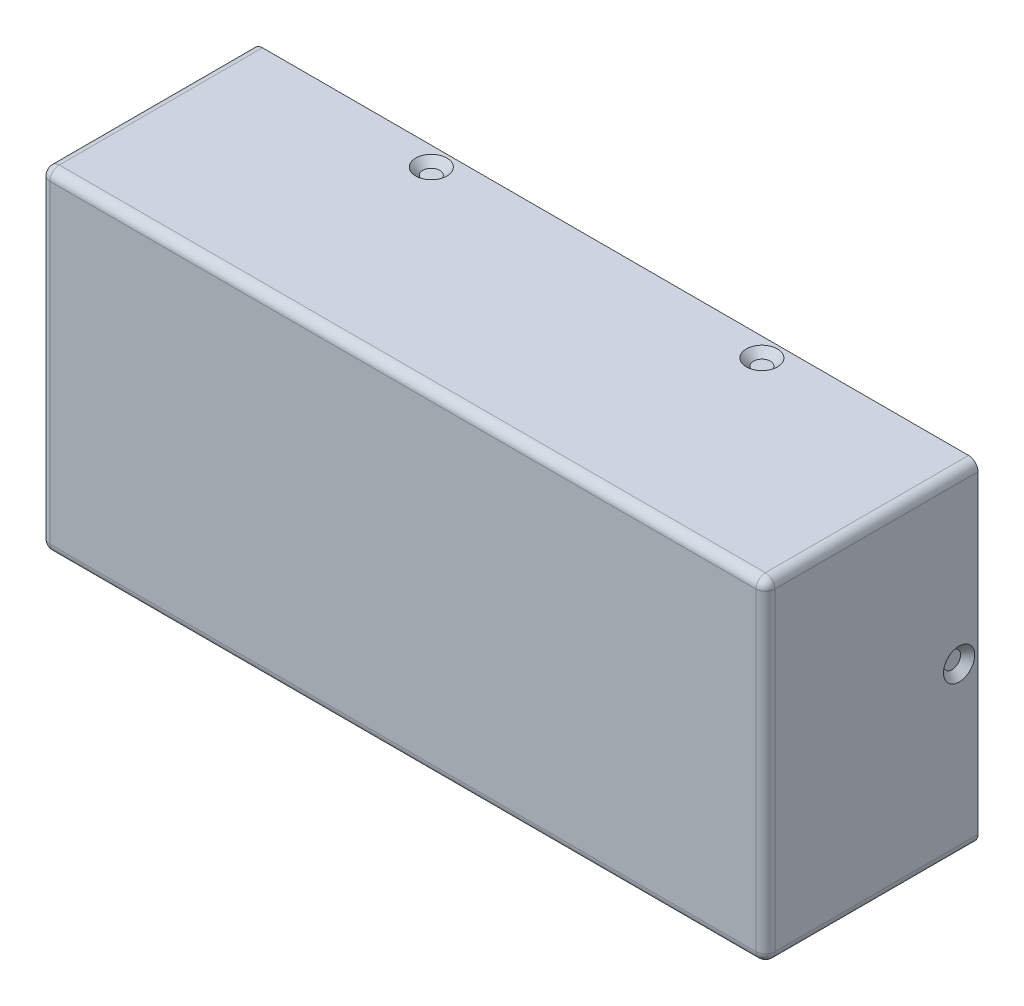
ISO-10303-21;
HEADER;
FILE_DESCRIPTION(('STEP AP214'),'2;1');
FILE_NAME('part.step','',(''),(''),'','','');
FILE_SCHEMA(('AUTOMOTIVE_DESIGN { 1 0 10303 214 1 1 1 1 }'));
ENDSEC;
DATA;
#1=APPLICATION_CONTEXT('core data for automotive mechanical design processes');
#2=APPLICATION_PROTOCOL_DEFINITION('international standard','automotive_design',2000,#1);
#3=PRODUCT_CONTEXT('',#1,'mechanical');
#4=PRODUCT('Part','Part','',(#3));
#5=PRODUCT_RELATED_PRODUCT_CATEGORY('part','',(#4));
#6=PRODUCT_DEFINITION_FORMATION('','',#4);
#7=PRODUCT_DEFINITION_CONTEXT('part definition',#1,'design');
#8=PRODUCT_DEFINITION('design','',#6,#7);
#9=PRODUCT_DEFINITION_SHAPE('','',#8);
#10=(LENGTH_UNIT() NAMED_UNIT(*) SI_UNIT(.MILLI.,.METRE.));
#11=(NAMED_UNIT(*) PLANE_ANGLE_UNIT() SI_UNIT($,.RADIAN.));
#12=(NAMED_UNIT(*) SI_UNIT($,.STERADIAN.) SOLID_ANGLE_UNIT());
#13=UNCERTAINTY_MEASURE_WITH_UNIT(LENGTH_MEASURE(1.E-05),#10,'distance_accuracy_value','');
#14=(GEOMETRIC_REPRESENTATION_CONTEXT(3) GLOBAL_UNCERTAINTY_ASSIGNED_CONTEXT((#13)) GLOBAL_UNIT_ASSIGNED_CONTEXT((#10,
#11,#12)) REPRESENTATION_CONTEXT('',''));
#15=CARTESIAN_POINT('',(0.,0.,0.));
#16=DIRECTION('',(0.,0.,1.));
#17=DIRECTION('',(1.,0.,0.));
#18=AXIS2_PLACEMENT_3D('',#15,#16,#17);
#19=CARTESIAN_POINT('',(75.,-33.5,12.));
#20=DIRECTION('',(1.,0.,0.));
#21=DIRECTION('',(0.,0.,-1.));
#22=AXIS2_PLACEMENT_3D('',#19,#20,#21);
#23=PLANE('',#22);
#24=DIRECTION('',(0.,-1.,0.));
#25=VECTOR('',#24,1.);
#26=CARTESIAN_POINT('',(75.,-33.5,0.));
#27=LINE('',#26,#25);
#28=CARTESIAN_POINT('',(75.,33.5,0.));
#29=VERTEX_POINT('',#28);
#30=CARTESIAN_POINT('',(75.,-33.5,0.));
#31=VERTEX_POINT('',#30);
#32=EDGE_CURVE('E109',#29,#31,#27,.T.);
#33=ORIENTED_EDGE('',*,*,#32,.F.);
#34=DIRECTION('',(0.,0.,-1.));
#35=VECTOR('',#34,1.);
#36=CARTESIAN_POINT('',(75.,33.5,12.));
#37=LINE('',#36,#35);
#38=CARTESIAN_POINT('',(75.,33.5,12.));
#39=VERTEX_POINT('',#38);
#40=EDGE_CURVE('E12',#39,#29,#37,.T.);
#41=ORIENTED_EDGE('',*,*,#40,.F.);
#42=DIRECTION('',(0.,-1.,0.));
#43=VECTOR('',#42,1.);
#44=CARTESIAN_POINT('',(75.,-33.5,12.));
#45=LINE('',#44,#43);
#46=CARTESIAN_POINT('',(75.,-33.5,12.));
#47=VERTEX_POINT('',#46);
#48=EDGE_CURVE('E103',#39,#47,#45,.T.);
#49=ORIENTED_EDGE('',*,*,#48,.T.);
#50=DIRECTION('',(0.,0.,-1.));
#51=VECTOR('',#50,1.);
#52=CARTESIAN_POINT('',(75.,-33.5,12.));
#53=LINE('',#52,#51);
#54=EDGE_CURVE('E48',#47,#31,#53,.T.);
#55=ORIENTED_EDGE('',*,*,#54,.T.);
#56=EDGE_LOOP('',(#33,#41,#49,#55));
#57=FACE_BOUND('',#56,.T.);
#58=ADVANCED_FACE('F45',(#57),#23,.T.);
#59=CARTESIAN_POINT('',(-75.,33.5,12.));
#60=DIRECTION('',(0.,1.,0.));
#61=DIRECTION('',(0.,0.,1.));
#62=AXIS2_PLACEMENT_3D('',#59,#60,#61);
#63=PLANE('',#62);
#64=DIRECTION('',(1.,0.,0.));
#65=VECTOR('',#64,1.);
#66=CARTESIAN_POINT('',(-75.,33.5,0.));
#67=LINE('',#66,#65);
#68=CARTESIAN_POINT('',(-75.,33.5,0.));
#69=VERTEX_POINT('',#68);
#70=EDGE_CURVE('E105',#69,#29,#67,.T.);
#71=ORIENTED_EDGE('',*,*,#70,.F.);
#72=DIRECTION('',(0.,0.,-1.));
#73=VECTOR('',#72,1.);
#74=CARTESIAN_POINT('',(-75.,33.5,12.));
#75=LINE('',#74,#73);
#76=CARTESIAN_POINT('',(-75.,33.5,12.));
#77=VERTEX_POINT('',#76);
#78=EDGE_CURVE('E54',#77,#69,#75,.T.);
#79=ORIENTED_EDGE('',*,*,#78,.F.);
#80=DIRECTION('',(1.,0.,0.));
#81=VECTOR('',#80,1.);
#82=CARTESIAN_POINT('',(-75.,33.5,12.));
#83=LINE('',#82,#81);
#84=EDGE_CURVE('E100',#77,#39,#83,.T.);
#85=ORIENTED_EDGE('',*,*,#84,.T.);
#86=ORIENTED_EDGE('',*,*,#40,.T.);
#87=EDGE_LOOP('',(#71,#79,#85,#86));
#88=FACE_BOUND('',#87,.T.);
#89=ADVANCED_FACE('F119',(#88),#63,.T.);
#90=CARTESIAN_POINT('',(-75.,-33.5,12.));
#91=DIRECTION('',(-1.,0.,0.));
#92=DIRECTION('',(0.,0.,1.));
#93=AXIS2_PLACEMENT_3D('',#90,#91,#92);
#94=PLANE('',#93);
#95=DIRECTION('',(0.,1.,0.));
#96=VECTOR('',#95,1.);
#97=CARTESIAN_POINT('',(-75.,-33.5,0.));
#98=LINE('',#97,#96);
#99=CARTESIAN_POINT('',(-75.,-33.5,0.));
#100=VERTEX_POINT('',#99);
#101=EDGE_CURVE('E95',#100,#69,#98,.T.);
#102=ORIENTED_EDGE('',*,*,#101,.F.);
#103=DIRECTION('',(0.,0.,-1.));
#104=VECTOR('',#103,1.);
#105=CARTESIAN_POINT('',(-75.,-33.5,12.));
#106=LINE('',#105,#104);
#107=CARTESIAN_POINT('',(-75.,-33.5,12.));
#108=VERTEX_POINT('',#107);
#109=EDGE_CURVE('E90',#108,#100,#106,.T.);
#110=ORIENTED_EDGE('',*,*,#109,.F.);
#111=DIRECTION('',(0.,1.,0.));
#112=VECTOR('',#111,1.);
#113=CARTESIAN_POINT('',(-75.,-33.5,12.));
#114=LINE('',#113,#112);
#115=EDGE_CURVE('E93',#108,#77,#114,.T.);
#116=ORIENTED_EDGE('',*,*,#115,.T.);
#117=ORIENTED_EDGE('',*,*,#78,.T.);
#118=EDGE_LOOP('',(#102,#110,#116,#117));
#119=FACE_BOUND('',#118,.T.);
#120=ADVANCED_FACE('F92',(#119),#94,.T.);
#121=CARTESIAN_POINT('',(-75.,-33.5,12.));
#122=DIRECTION('',(0.,-1.,0.));
#123=DIRECTION('',(0.,0.,-1.));
#124=AXIS2_PLACEMENT_3D('',#121,#122,#123);
#125=PLANE('',#124);
#126=DIRECTION('',(-1.,0.,0.));
#127=VECTOR('',#126,1.);
#128=CARTESIAN_POINT('',(-75.,-33.5,0.));
#129=LINE('',#128,#127);
#130=EDGE_CURVE('E112',#31,#100,#129,.T.);
#131=ORIENTED_EDGE('',*,*,#130,.F.);
#132=ORIENTED_EDGE('',*,*,#54,.F.);
#133=DIRECTION('',(-1.,0.,0.));
#134=VECTOR('',#133,1.);
#135=CARTESIAN_POINT('',(-75.,-33.5,12.));
#136=LINE('',#135,#134);
#137=EDGE_CURVE('E99',#47,#108,#136,.T.);
#138=ORIENTED_EDGE('',*,*,#137,.T.);
#139=ORIENTED_EDGE('',*,*,#109,.T.);
#140=EDGE_LOOP('',(#131,#132,#138,#139));
#141=FACE_BOUND('',#140,.T.);
#142=ADVANCED_FACE('F102',(#141),#125,.T.);
#143=CARTESIAN_POINT('',(0.,0.,12.));
#144=DIRECTION('',(0.,0.,-1.));
#145=DIRECTION('',(-1.,0.,0.));
#146=AXIS2_PLACEMENT_3D('',#143,#144,#145);
#147=PLANE('',#146);
#148=ORIENTED_EDGE('',*,*,#48,.F.);
#149=ORIENTED_EDGE('',*,*,#84,.F.);
#150=ORIENTED_EDGE('',*,*,#115,.F.);
#151=ORIENTED_EDGE('',*,*,#137,.F.);
#152=EDGE_LOOP('',(#148,#149,#150,#151));
#153=FACE_BOUND('',#152,.T.);
#154=ADVANCED_FACE('F98',(#153),#147,.F.);
#155=CARTESIAN_POINT('',(0.,0.,0.));
#156=DIRECTION('',(0.,0.,-1.));
#157=DIRECTION('',(-1.,0.,0.));
#158=AXIS2_PLACEMENT_3D('',#155,#156,#157);
#159=PLANE('',#158);
#160=ORIENTED_EDGE('',*,*,#32,.T.);
#161=ORIENTED_EDGE('',*,*,#130,.T.);
#162=ORIENTED_EDGE('',*,*,#101,.T.);
#163=ORIENTED_EDGE('',*,*,#70,.T.);
#164=EDGE_LOOP('',(#160,#161,#162,#163));
#165=FACE_BOUND('',#164,.T.);
#166=ADVANCED_FACE('F118',(#165),#159,.T.);
#167=CLOSED_SHELL('',(#58,#89,#120,#142,#154,#166));
#168=MANIFOLD_SOLID_BREP('B2',#167);
#169=CARTESIAN_POINT('',(76.75,-35.25,45.));
#170=DIRECTION('',(-1.,0.,0.));
#171=DIRECTION('',(0.,0.,1.));
#172=AXIS2_PLACEMENT_3D('',#169,#170,#171);
#173=PLANE('',#172);
#174=DIRECTION('',(0.,1.,0.));
#175=VECTOR('',#174,1.);
#176=CARTESIAN_POINT('',(76.75,-35.25,43.));
#177=LINE('',#176,#175);
#178=CARTESIAN_POINT('',(76.75,33.25,43.));
#179=VERTEX_POINT('',#178);
#180=CARTESIAN_POINT('',(76.75,-33.25,43.));
#181=VERTEX_POINT('',#180);
#182=EDGE_CURVE('E194',#179,#181,#177,.F.);
#183=ORIENTED_EDGE('',*,*,#182,.T.);
#184=DIRECTION('',(0.,0.,-1.));
#185=VECTOR('',#184,1.);
#186=CARTESIAN_POINT('',(76.75,-33.25,45.));
#187=LINE('',#186,#185);
#188=CARTESIAN_POINT('',(76.75,-33.25,0.));
#189=VERTEX_POINT('',#188);
#190=EDGE_CURVE('E421',#181,#189,#187,.T.);
#191=ORIENTED_EDGE('',*,*,#190,.T.);
#192=DIRECTION('',(0.,1.,0.));
#193=VECTOR('',#192,1.);
#194=CARTESIAN_POINT('',(76.75,-35.25,0.));
#195=LINE('',#194,#193);
#196=CARTESIAN_POINT('',(76.75,33.25,0.));
#197=VERTEX_POINT('',#196);
#198=EDGE_CURVE('E378',#189,#197,#195,.T.);
#199=ORIENTED_EDGE('',*,*,#198,.T.);
#200=DIRECTION('',(0.,0.,-1.));
#201=VECTOR('',#200,1.);
#202=CARTESIAN_POINT('',(76.75,33.25,45.));
#203=LINE('',#202,#201);
#204=EDGE_CURVE('E418',#197,#179,#203,.F.);
#205=ORIENTED_EDGE('',*,*,#204,.T.);
#206=EDGE_LOOP('',(#183,#191,#199,#205));
#207=FACE_BOUND('',#206,.T.);
#208=CARTESIAN_POINT('',(76.75,0.,4.));
#209=DIRECTION('',(1.,0.,0.));
#210=DIRECTION('',(0.,0.,-1.));
#211=AXIS2_PLACEMENT_3D('',#208,#209,#210);
#212=CIRCLE('',#211,3.3);
#213=CARTESIAN_POINT('',(76.75,0.,0.699999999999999));
#214=VERTEX_POINT('',#213);
#215=EDGE_CURVE('E905',#214,#214,#212,.T.);
#216=ORIENTED_EDGE('',*,*,#215,.F.);
#217=EDGE_LOOP('',(#216));
#218=FACE_BOUND('',#217,.T.);
#219=ADVANCED_FACE('F169',(#207,#218),#173,.F.);
#220=CARTESIAN_POINT('',(-76.75,35.25,45.));
#221=DIRECTION('',(0.,-1.,0.));
#222=DIRECTION('',(0.,0.,-1.));
#223=AXIS2_PLACEMENT_3D('',#220,#221,#222);
#224=PLANE('',#223);
#225=CARTESIAN_POINT('',(35.,35.25,4.00000000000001));
#226=DIRECTION('',(0.,1.,0.));
#227=DIRECTION('',(0.,0.,1.));
#228=AXIS2_PLACEMENT_3D('',#225,#226,#227);
#229=CIRCLE('',#228,3.3);
#230=CARTESIAN_POINT('',(35.,35.25,7.30000000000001));
#231=VERTEX_POINT('',#230);
#232=EDGE_CURVE('E902',#231,#231,#229,.T.);
#233=ORIENTED_EDGE('',*,*,#232,.F.);
#234=EDGE_LOOP('',(#233));
#235=FACE_BOUND('',#234,.T.);
#236=DIRECTION('',(-1.,0.,0.));
#237=VECTOR('',#236,1.);
#238=CARTESIAN_POINT('',(-76.75,35.25,0.));
#239=LINE('',#238,#237);
#240=CARTESIAN_POINT('',(74.75,35.25,0.));
#241=VERTEX_POINT('',#240);
#242=CARTESIAN_POINT('',(-74.75,35.25,0.));
#243=VERTEX_POINT('',#242);
#244=EDGE_CURVE('E381',#241,#243,#239,.T.);
#245=ORIENTED_EDGE('',*,*,#244,.T.);
#246=DIRECTION('',(0.,0.,-1.));
#247=VECTOR('',#246,1.);
#248=CARTESIAN_POINT('',(-74.75,35.25,45.));
#249=LINE('',#248,#247);
#250=CARTESIAN_POINT('',(-74.75,35.25,43.));
#251=VERTEX_POINT('',#250);
#252=EDGE_CURVE('E416',#243,#251,#249,.F.);
#253=ORIENTED_EDGE('',*,*,#252,.T.);
#254=DIRECTION('',(-1.,0.,0.));
#255=VECTOR('',#254,1.);
#256=CARTESIAN_POINT('',(-76.75,35.25,43.));
#257=LINE('',#256,#255);
#258=CARTESIAN_POINT('',(74.75,35.25,43.));
#259=VERTEX_POINT('',#258);
#260=EDGE_CURVE('E414',#251,#259,#257,.F.);
#261=ORIENTED_EDGE('',*,*,#260,.T.);
#262=DIRECTION('',(0.,0.,-1.));
#263=VECTOR('',#262,1.);
#264=CARTESIAN_POINT('',(74.75,35.25,45.));
#265=LINE('',#264,#263);
#266=EDGE_CURVE('E412',#259,#241,#265,.T.);
#267=ORIENTED_EDGE('',*,*,#266,.T.);
#268=EDGE_LOOP('',(#245,#253,#261,#267));
#269=FACE_BOUND('',#268,.T.);
#270=CARTESIAN_POINT('',(-35.,35.25,4.));
#271=DIRECTION('',(0.,1.,0.));
#272=DIRECTION('',(0.,0.,1.));
#273=AXIS2_PLACEMENT_3D('',#270,#271,#272);
#274=CIRCLE('',#273,3.3);
#275=CARTESIAN_POINT('',(-35.,35.25,7.3));
#276=VERTEX_POINT('',#275);
#277=EDGE_CURVE('E914',#276,#276,#274,.T.);
#278=ORIENTED_EDGE('',*,*,#277,.F.);
#279=EDGE_LOOP('',(#278));
#280=FACE_BOUND('',#279,.T.);
#281=ADVANCED_FACE('F483',(#235,#269,#280),#224,.F.);
#282=CARTESIAN_POINT('',(0.,0.,0.));
#283=DIRECTION('',(0.,0.,-1.));
#284=DIRECTION('',(-1.,0.,0.));
#285=AXIS2_PLACEMENT_3D('',#282,#283,#284);
#286=PLANE('',#285);
#287=DIRECTION('',(1.,0.,0.));
#288=VECTOR('',#287,1.);
#289=CARTESIAN_POINT('',(-76.75,-35.25,0.));
#290=LINE('',#289,#288);
#291=CARTESIAN_POINT('',(-74.75,-35.25,0.));
#292=VERTEX_POINT('',#291);
#293=CARTESIAN_POINT('',(74.75,-35.25,0.));
#294=VERTEX_POINT('',#293);
#295=EDGE_CURVE('E387',#292,#294,#290,.T.);
#296=ORIENTED_EDGE('',*,*,#295,.F.);
#297=CARTESIAN_POINT('',(-74.75,-33.25,0.));
#298=DIRECTION('',(0.,0.,-1.));
#299=DIRECTION('',(-1.,0.,0.));
#300=AXIS2_PLACEMENT_3D('',#297,#298,#299);
#301=CIRCLE('',#300,2.);
#302=CARTESIAN_POINT('',(-76.75,-33.25,0.));
#303=VERTEX_POINT('',#302);
#304=EDGE_CURVE('E43',#292,#303,#301,.T.);
#305=ORIENTED_EDGE('',*,*,#304,.T.);
#306=DIRECTION('',(0.,-1.,0.));
#307=VECTOR('',#306,1.);
#308=CARTESIAN_POINT('',(-76.75,-35.25,0.));
#309=LINE('',#308,#307);
#310=CARTESIAN_POINT('',(-76.75,33.25,0.));
#311=VERTEX_POINT('',#310);
#312=EDGE_CURVE('E384',#311,#303,#309,.T.);
#313=ORIENTED_EDGE('',*,*,#312,.F.);
#314=CARTESIAN_POINT('',(-74.75,33.25,0.));
#315=DIRECTION('',(0.,0.,-1.));
#316=DIRECTION('',(-1.,0.,0.));
#317=AXIS2_PLACEMENT_3D('',#314,#315,#316);
#318=CIRCLE('',#317,2.);
#319=EDGE_CURVE('E178',#311,#243,#318,.T.);
#320=ORIENTED_EDGE('',*,*,#319,.T.);
#321=ORIENTED_EDGE('',*,*,#244,.F.);
#322=CARTESIAN_POINT('',(74.75,33.25,0.));
#323=DIRECTION('',(0.,0.,-1.));
#324=DIRECTION('',(-1.,0.,0.));
#325=AXIS2_PLACEMENT_3D('',#322,#323,#324);
#326=CIRCLE('',#325,2.);
#327=EDGE_CURVE('E423',#241,#197,#326,.T.);
#328=ORIENTED_EDGE('',*,*,#327,.T.);
#329=ORIENTED_EDGE('',*,*,#198,.F.);
#330=CARTESIAN_POINT('',(74.75,-33.25,0.));
#331=DIRECTION('',(0.,0.,-1.));
#332=DIRECTION('',(-1.,0.,0.));
#333=AXIS2_PLACEMENT_3D('',#330,#331,#332);
#334=CIRCLE('',#333,2.);
#335=EDGE_CURVE('E425',#189,#294,#334,.T.);
#336=ORIENTED_EDGE('',*,*,#335,.T.);
#337=EDGE_LOOP('',(#296,#305,#313,#320,#321,#328,#329,#336));
#338=FACE_BOUND('',#337,.T.);
#339=CARTESIAN_POINT('',(-74.75,-33.25,0.));
#340=DIRECTION('',(0.,0.,-1.));
#341=DIRECTION('',(-1.,0.,0.));
#342=AXIS2_PLACEMENT_3D('',#339,#340,#341);
#343=CIRCLE('',#342,0.5);
#344=CARTESIAN_POINT('',(-74.75,-33.75,0.));
#345=VERTEX_POINT('',#344);
#346=CARTESIAN_POINT('',(-75.25,-33.25,0.));
#347=VERTEX_POINT('',#346);
#348=EDGE_CURVE('E369',#345,#347,#343,.T.);
#349=ORIENTED_EDGE('',*,*,#348,.F.);
#350=DIRECTION('',(1.,0.,0.));
#351=VECTOR('',#350,1.);
#352=CARTESIAN_POINT('',(0.,-33.75,0.));
#353=LINE('',#352,#351);
#354=CARTESIAN_POINT('',(74.75,-33.75,0.));
#355=VERTEX_POINT('',#354);
#356=EDGE_CURVE('E364',#345,#355,#353,.T.);
#357=ORIENTED_EDGE('',*,*,#356,.T.);
#358=CARTESIAN_POINT('',(74.75,-33.25,0.));
#359=DIRECTION('',(0.,0.,-1.));
#360=DIRECTION('',(-1.,0.,0.));
#361=AXIS2_PLACEMENT_3D('',#358,#359,#360);
#362=CIRCLE('',#361,0.5);
#363=CARTESIAN_POINT('',(75.25,-33.25,0.));
#364=VERTEX_POINT('',#363);
#365=EDGE_CURVE('E361',#364,#355,#362,.T.);
#366=ORIENTED_EDGE('',*,*,#365,.F.);
#367=DIRECTION('',(0.,1.,0.));
#368=VECTOR('',#367,1.);
#369=CARTESIAN_POINT('',(75.25,0.,0.));
#370=LINE('',#369,#368);
#371=CARTESIAN_POINT('',(75.25,33.25,0.));
#372=VERTEX_POINT('',#371);
#373=EDGE_CURVE('E186',#364,#372,#370,.T.);
#374=ORIENTED_EDGE('',*,*,#373,.T.);
#375=CARTESIAN_POINT('',(74.75,33.25,0.));
#376=DIRECTION('',(0.,0.,-1.));
#377=DIRECTION('',(-1.,0.,0.));
#378=AXIS2_PLACEMENT_3D('',#375,#376,#377);
#379=CIRCLE('',#378,0.5);
#380=CARTESIAN_POINT('',(74.7499999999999,33.75,0.));
#381=VERTEX_POINT('',#380);
#382=EDGE_CURVE('E324',#381,#372,#379,.T.);
#383=ORIENTED_EDGE('',*,*,#382,.F.);
#384=DIRECTION('',(-1.,0.,0.));
#385=VECTOR('',#384,1.);
#386=CARTESIAN_POINT('',(0.,33.75,0.));
#387=LINE('',#386,#385);
#388=CARTESIAN_POINT('',(-74.75,33.75,0.));
#389=VERTEX_POINT('',#388);
#390=EDGE_CURVE('E359',#381,#389,#387,.T.);
#391=ORIENTED_EDGE('',*,*,#390,.T.);
#392=CARTESIAN_POINT('',(-74.75,33.25,0.));
#393=DIRECTION('',(0.,0.,-1.));
#394=DIRECTION('',(-1.,0.,0.));
#395=AXIS2_PLACEMENT_3D('',#392,#393,#394);
#396=CIRCLE('',#395,0.5);
#397=CARTESIAN_POINT('',(-75.25,33.25,0.));
#398=VERTEX_POINT('',#397);
#399=EDGE_CURVE('E363',#398,#389,#396,.T.);
#400=ORIENTED_EDGE('',*,*,#399,.F.);
#401=DIRECTION('',(0.,-1.,0.));
#402=VECTOR('',#401,1.);
#403=CARTESIAN_POINT('',(-75.25,0.,0.));
#404=LINE('',#403,#402);
#405=EDGE_CURVE('E368',#398,#347,#404,.T.);
#406=ORIENTED_EDGE('',*,*,#405,.T.);
#407=EDGE_LOOP('',(#349,#357,#366,#374,#383,#391,#400,#406));
#408=FACE_BOUND('',#407,.T.);
#409=ADVANCED_FACE('F495',(#338,#408),#286,.T.);
#410=CARTESIAN_POINT('',(-76.75,-35.25,45.));
#411=DIRECTION('',(1.,0.,0.));
#412=DIRECTION('',(0.,0.,-1.));
#413=AXIS2_PLACEMENT_3D('',#410,#411,#412);
#414=PLANE('',#413);
#415=CARTESIAN_POINT('',(-76.75,0.,4.));
#416=DIRECTION('',(-1.,0.,0.));
#417=DIRECTION('',(0.,0.,1.));
#418=AXIS2_PLACEMENT_3D('',#415,#416,#417);
#419=CIRCLE('',#418,3.3);
#420=CARTESIAN_POINT('',(-76.75,0.,7.3));
#421=VERTEX_POINT('',#420);
#422=EDGE_CURVE('E897',#421,#421,#419,.T.);
#423=ORIENTED_EDGE('',*,*,#422,.F.);
#424=EDGE_LOOP('',(#423));
#425=FACE_BOUND('',#424,.T.);
#426=ORIENTED_EDGE('',*,*,#312,.T.);
#427=DIRECTION('',(0.,0.,-1.));
#428=VECTOR('',#427,1.);
#429=CARTESIAN_POINT('',(-76.75,-33.25,45.));
#430=LINE('',#429,#428);
#431=CARTESIAN_POINT('',(-76.75,-33.25,43.));
#432=VERTEX_POINT('',#431);
#433=EDGE_CURVE('E410',#303,#432,#430,.F.);
#434=ORIENTED_EDGE('',*,*,#433,.T.);
#435=DIRECTION('',(0.,-1.,0.));
#436=VECTOR('',#435,1.);
#437=CARTESIAN_POINT('',(-76.75,-35.25,43.));
#438=LINE('',#437,#436);
#439=CARTESIAN_POINT('',(-76.75,33.25,43.));
#440=VERTEX_POINT('',#439);
#441=EDGE_CURVE('E408',#432,#440,#438,.F.);
#442=ORIENTED_EDGE('',*,*,#441,.T.);
#443=DIRECTION('',(0.,0.,-1.));
#444=VECTOR('',#443,1.);
#445=CARTESIAN_POINT('',(-76.75,33.25,45.));
#446=LINE('',#445,#444);
#447=EDGE_CURVE('E406',#440,#311,#446,.T.);
#448=ORIENTED_EDGE('',*,*,#447,.T.);
#449=EDGE_LOOP('',(#426,#434,#442,#448));
#450=FACE_BOUND('',#449,.T.);
#451=ADVANCED_FACE('F521',(#425,#450),#414,.F.);
#452=CARTESIAN_POINT('',(-76.75,-35.25,45.));
#453=DIRECTION('',(0.,1.,0.));
#454=DIRECTION('',(0.,0.,1.));
#455=AXIS2_PLACEMENT_3D('',#452,#453,#454);
#456=PLANE('',#455);
#457=CARTESIAN_POINT('',(35.,-35.25,4.00000000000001));
#458=DIRECTION('',(0.,-1.,0.));
#459=DIRECTION('',(0.,0.,-1.));
#460=AXIS2_PLACEMENT_3D('',#457,#458,#459);
#461=CIRCLE('',#460,3.3);
#462=CARTESIAN_POINT('',(35.,-35.25,0.700000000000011));
#463=VERTEX_POINT('',#462);
#464=EDGE_CURVE('E920',#463,#463,#461,.T.);
#465=ORIENTED_EDGE('',*,*,#464,.F.);
#466=EDGE_LOOP('',(#465));
#467=FACE_BOUND('',#466,.T.);
#468=CARTESIAN_POINT('',(-35.,-35.25,4.));
#469=DIRECTION('',(0.,-1.,0.));
#470=DIRECTION('',(0.,0.,-1.));
#471=AXIS2_PLACEMENT_3D('',#468,#469,#470);
#472=CIRCLE('',#471,3.3);
#473=CARTESIAN_POINT('',(-35.,-35.25,0.700000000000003));
#474=VERTEX_POINT('',#473);
#475=EDGE_CURVE('E926',#474,#474,#472,.T.);
#476=ORIENTED_EDGE('',*,*,#475,.F.);
#477=EDGE_LOOP('',(#476));
#478=FACE_BOUND('',#477,.T.);
#479=DIRECTION('',(1.,0.,0.));
#480=VECTOR('',#479,1.);
#481=CARTESIAN_POINT('',(-76.75,-35.25,43.));
#482=LINE('',#481,#480);
#483=CARTESIAN_POINT('',(74.75,-35.25,43.));
#484=VERTEX_POINT('',#483);
#485=CARTESIAN_POINT('',(-74.75,-35.25,43.));
#486=VERTEX_POINT('',#485);
#487=EDGE_CURVE('E401',#484,#486,#482,.F.);
#488=ORIENTED_EDGE('',*,*,#487,.T.);
#489=DIRECTION('',(0.,0.,-1.));
#490=VECTOR('',#489,1.);
#491=CARTESIAN_POINT('',(-74.75,-35.25,45.));
#492=LINE('',#491,#490);
#493=EDGE_CURVE('E404',#486,#292,#492,.T.);
#494=ORIENTED_EDGE('',*,*,#493,.T.);
#495=ORIENTED_EDGE('',*,*,#295,.T.);
#496=DIRECTION('',(0.,0.,-1.));
#497=VECTOR('',#496,1.);
#498=CARTESIAN_POINT('',(74.75,-35.25,45.));
#499=LINE('',#498,#497);
#500=EDGE_CURVE('E399',#294,#484,#499,.F.);
#501=ORIENTED_EDGE('',*,*,#500,.T.);
#502=EDGE_LOOP('',(#488,#494,#495,#501));
#503=FACE_BOUND('',#502,.T.);
#504=ADVANCED_FACE('F513',(#467,#478,#503),#456,.F.);
#505=CARTESIAN_POINT('',(0.,0.,45.));
#506=DIRECTION('',(0.,0.,-1.));
#507=DIRECTION('',(-1.,0.,0.));
#508=AXIS2_PLACEMENT_3D('',#505,#506,#507);
#509=PLANE('',#508);
#510=DIRECTION('',(0.,-1.,0.));
#511=VECTOR('',#510,1.);
#512=CARTESIAN_POINT('',(-74.75,0.,45.));
#513=LINE('',#512,#511);
#514=CARTESIAN_POINT('',(-74.75,33.25,45.));
#515=VERTEX_POINT('',#514);
#516=CARTESIAN_POINT('',(-74.75,-33.25,45.));
#517=VERTEX_POINT('',#516);
#518=EDGE_CURVE('E394',#515,#517,#513,.T.);
#519=ORIENTED_EDGE('',*,*,#518,.T.);
#520=DIRECTION('',(1.,0.,0.));
#521=VECTOR('',#520,1.);
#522=CARTESIAN_POINT('',(0.,-33.25,45.));
#523=LINE('',#522,#521);
#524=CARTESIAN_POINT('',(74.75,-33.25,45.));
#525=VERTEX_POINT('',#524);
#526=EDGE_CURVE('E396',#517,#525,#523,.T.);
#527=ORIENTED_EDGE('',*,*,#526,.T.);
#528=DIRECTION('',(0.,1.,0.));
#529=VECTOR('',#528,1.);
#530=CARTESIAN_POINT('',(74.75,0.,45.));
#531=LINE('',#530,#529);
#532=CARTESIAN_POINT('',(74.75,33.25,45.));
#533=VERTEX_POINT('',#532);
#534=EDGE_CURVE('E390',#525,#533,#531,.T.);
#535=ORIENTED_EDGE('',*,*,#534,.T.);
#536=DIRECTION('',(-1.,0.,0.));
#537=VECTOR('',#536,1.);
#538=CARTESIAN_POINT('',(0.,33.25,45.));
#539=LINE('',#538,#537);
#540=EDGE_CURVE('E392',#533,#515,#539,.T.);
#541=ORIENTED_EDGE('',*,*,#540,.T.);
#542=EDGE_LOOP('',(#519,#527,#535,#541));
#543=FACE_BOUND('',#542,.T.);
#544=ADVANCED_FACE('F473',(#543),#509,.F.);
#545=CARTESIAN_POINT('',(-74.75,33.25,45.));
#546=DIRECTION('',(0.,0.,-1.));
#547=DIRECTION('',(-1.,0.,0.));
#548=AXIS2_PLACEMENT_3D('',#545,#546,#547);
#549=CYLINDRICAL_SURFACE('',#548,2.);
#550=ORIENTED_EDGE('',*,*,#319,.F.);
#551=ORIENTED_EDGE('',*,*,#447,.F.);
#552=CARTESIAN_POINT('',(-74.75,33.25,43.));
#553=DIRECTION('',(0.,0.,1.));
#554=DIRECTION('',(1.,0.,0.));
#555=AXIS2_PLACEMENT_3D('',#552,#553,#554);
#556=CIRCLE('',#555,2.);
#557=EDGE_CURVE('E173',#251,#440,#556,.T.);
#558=ORIENTED_EDGE('',*,*,#557,.F.);
#559=ORIENTED_EDGE('',*,*,#252,.F.);
#560=EDGE_LOOP('',(#550,#551,#558,#559));
#561=FACE_BOUND('',#560,.T.);
#562=ADVANCED_FACE('F171',(#561),#549,.T.);
#563=CARTESIAN_POINT('',(0.,33.25,43.));
#564=DIRECTION('',(-1.,0.,0.));
#565=DIRECTION('',(0.,0.,1.));
#566=AXIS2_PLACEMENT_3D('',#563,#564,#565);
#567=CYLINDRICAL_SURFACE('',#566,2.);
#568=CARTESIAN_POINT('',(74.75,33.25,43.));
#569=DIRECTION('',(1.,0.,0.));
#570=DIRECTION('',(0.,0.,-1.));
#571=AXIS2_PLACEMENT_3D('',#568,#569,#570);
#572=CIRCLE('',#571,2.);
#573=EDGE_CURVE('E452',#259,#533,#572,.T.);
#574=ORIENTED_EDGE('',*,*,#573,.F.);
#575=ORIENTED_EDGE('',*,*,#260,.F.);
#576=CARTESIAN_POINT('',(-74.75,33.25,43.));
#577=DIRECTION('',(-1.,0.,0.));
#578=DIRECTION('',(0.,0.,1.));
#579=AXIS2_PLACEMENT_3D('',#576,#577,#578);
#580=CIRCLE('',#579,2.);
#581=EDGE_CURVE('E454',#515,#251,#580,.T.);
#582=ORIENTED_EDGE('',*,*,#581,.F.);
#583=ORIENTED_EDGE('',*,*,#540,.F.);
#584=EDGE_LOOP('',(#574,#575,#582,#583));
#585=FACE_BOUND('',#584,.T.);
#586=ADVANCED_FACE('F480',(#585),#567,.T.);
#587=CARTESIAN_POINT('',(74.75,33.25,45.));
#588=DIRECTION('',(0.,0.,-1.));
#589=DIRECTION('',(-1.,0.,0.));
#590=AXIS2_PLACEMENT_3D('',#587,#588,#589);
#591=CYLINDRICAL_SURFACE('',#590,2.);
#592=ORIENTED_EDGE('',*,*,#327,.F.);
#593=ORIENTED_EDGE('',*,*,#266,.F.);
#594=CARTESIAN_POINT('',(74.75,33.25,43.));
#595=DIRECTION('',(0.,0.,1.));
#596=DIRECTION('',(1.,0.,0.));
#597=AXIS2_PLACEMENT_3D('',#594,#595,#596);
#598=CIRCLE('',#597,2.);
#599=EDGE_CURVE('E449',#179,#259,#598,.T.);
#600=ORIENTED_EDGE('',*,*,#599,.F.);
#601=ORIENTED_EDGE('',*,*,#204,.F.);
#602=EDGE_LOOP('',(#592,#593,#600,#601));
#603=FACE_BOUND('',#602,.T.);
#604=ADVANCED_FACE('F489',(#603),#591,.T.);
#605=CARTESIAN_POINT('',(-74.75,33.25,43.));
#606=DIRECTION('',(0.,0.,1.));
#607=DIRECTION('',(1.,0.,0.));
#608=AXIS2_PLACEMENT_3D('',#605,#606,#607);
#609=SPHERICAL_SURFACE('',#608,2.);
#610=ORIENTED_EDGE('',*,*,#581,.T.);
#611=ORIENTED_EDGE('',*,*,#557,.T.);
#612=CARTESIAN_POINT('',(-74.75,33.25,43.));
#613=DIRECTION('',(0.,1.,0.));
#614=DIRECTION('',(0.,0.,1.));
#615=AXIS2_PLACEMENT_3D('',#612,#613,#614);
#616=CIRCLE('',#615,2.);
#617=EDGE_CURVE('E446',#515,#440,#616,.F.);
#618=ORIENTED_EDGE('',*,*,#617,.F.);
#619=EDGE_LOOP('',(#610,#611,#618));
#620=FACE_BOUND('',#619,.T.);
#621=ADVANCED_FACE('F461',(#620),#609,.T.);
#622=CARTESIAN_POINT('',(74.75,33.25,43.));
#623=DIRECTION('',(0.,0.,1.));
#624=DIRECTION('',(1.,0.,0.));
#625=AXIS2_PLACEMENT_3D('',#622,#623,#624);
#626=SPHERICAL_SURFACE('',#625,2.);
#627=ORIENTED_EDGE('',*,*,#599,.T.);
#628=ORIENTED_EDGE('',*,*,#573,.T.);
#629=CARTESIAN_POINT('',(74.75,33.25,43.));
#630=DIRECTION('',(0.,1.,0.));
#631=DIRECTION('',(0.,0.,1.));
#632=AXIS2_PLACEMENT_3D('',#629,#630,#631);
#633=CIRCLE('',#632,2.);
#634=EDGE_CURVE('E443',#179,#533,#633,.F.);
#635=ORIENTED_EDGE('',*,*,#634,.F.);
#636=EDGE_LOOP('',(#627,#628,#635));
#637=FACE_BOUND('',#636,.T.);
#638=ADVANCED_FACE('F554',(#637),#626,.T.);
#639=CARTESIAN_POINT('',(-74.75,-33.25,45.));
#640=DIRECTION('',(0.,0.,-1.));
#641=DIRECTION('',(-1.,0.,0.));
#642=AXIS2_PLACEMENT_3D('',#639,#640,#641);
#643=CYLINDRICAL_SURFACE('',#642,2.);
#644=ORIENTED_EDGE('',*,*,#304,.F.);
#645=ORIENTED_EDGE('',*,*,#493,.F.);
#646=CARTESIAN_POINT('',(-74.75,-33.25,43.));
#647=DIRECTION('',(0.,0.,1.));
#648=DIRECTION('',(1.,0.,0.));
#649=AXIS2_PLACEMENT_3D('',#646,#647,#648);
#650=CIRCLE('',#649,2.);
#651=EDGE_CURVE('E440',#432,#486,#650,.T.);
#652=ORIENTED_EDGE('',*,*,#651,.F.);
#653=ORIENTED_EDGE('',*,*,#433,.F.);
#654=EDGE_LOOP('',(#644,#645,#652,#653));
#655=FACE_BOUND('',#654,.T.);
#656=ADVANCED_FACE('F519',(#655),#643,.T.);
#657=CARTESIAN_POINT('',(-74.75,0.,43.));
#658=DIRECTION('',(0.,-1.,0.));
#659=DIRECTION('',(0.,0.,-1.));
#660=AXIS2_PLACEMENT_3D('',#657,#658,#659);
#661=CYLINDRICAL_SURFACE('',#660,2.);
#662=ORIENTED_EDGE('',*,*,#617,.T.);
#663=ORIENTED_EDGE('',*,*,#441,.F.);
#664=CARTESIAN_POINT('',(-74.75,-33.25,43.));
#665=DIRECTION('',(0.,-1.,0.));
#666=DIRECTION('',(0.,0.,-1.));
#667=AXIS2_PLACEMENT_3D('',#664,#665,#666);
#668=CIRCLE('',#667,2.);
#669=EDGE_CURVE('E437',#517,#432,#668,.T.);
#670=ORIENTED_EDGE('',*,*,#669,.F.);
#671=ORIENTED_EDGE('',*,*,#518,.F.);
#672=EDGE_LOOP('',(#662,#663,#670,#671));
#673=FACE_BOUND('',#672,.T.);
#674=ADVANCED_FACE('F468',(#673),#661,.T.);
#675=CARTESIAN_POINT('',(74.75,0.,43.));
#676=DIRECTION('',(0.,1.,0.));
#677=DIRECTION('',(0.,0.,1.));
#678=AXIS2_PLACEMENT_3D('',#675,#676,#677);
#679=CYLINDRICAL_SURFACE('',#678,2.);
#680=ORIENTED_EDGE('',*,*,#634,.T.);
#681=ORIENTED_EDGE('',*,*,#534,.F.);
#682=CARTESIAN_POINT('',(74.75,-33.25,43.));
#683=DIRECTION('',(0.,-1.,0.));
#684=DIRECTION('',(0.,0.,-1.));
#685=AXIS2_PLACEMENT_3D('',#682,#683,#684);
#686=CIRCLE('',#685,2.);
#687=EDGE_CURVE('E434',#181,#525,#686,.T.);
#688=ORIENTED_EDGE('',*,*,#687,.F.);
#689=ORIENTED_EDGE('',*,*,#182,.F.);
#690=EDGE_LOOP('',(#680,#681,#688,#689));
#691=FACE_BOUND('',#690,.T.);
#692=ADVANCED_FACE('F506',(#691),#679,.T.);
#693=CARTESIAN_POINT('',(74.75,-33.25,45.));
#694=DIRECTION('',(0.,0.,-1.));
#695=DIRECTION('',(-1.,0.,0.));
#696=AXIS2_PLACEMENT_3D('',#693,#694,#695);
#697=CYLINDRICAL_SURFACE('',#696,2.);
#698=ORIENTED_EDGE('',*,*,#335,.F.);
#699=ORIENTED_EDGE('',*,*,#190,.F.);
#700=CARTESIAN_POINT('',(74.75,-33.25,43.));
#701=DIRECTION('',(0.,0.,1.));
#702=DIRECTION('',(1.,0.,0.));
#703=AXIS2_PLACEMENT_3D('',#700,#701,#702);
#704=CIRCLE('',#703,2.);
#705=EDGE_CURVE('E431',#484,#181,#704,.T.);
#706=ORIENTED_EDGE('',*,*,#705,.F.);
#707=ORIENTED_EDGE('',*,*,#500,.F.);
#708=EDGE_LOOP('',(#698,#699,#706,#707));
#709=FACE_BOUND('',#708,.T.);
#710=ADVANCED_FACE('F502',(#709),#697,.T.);
#711=CARTESIAN_POINT('',(-74.75,-33.25,43.));
#712=DIRECTION('',(0.,0.,1.));
#713=DIRECTION('',(1.,0.,0.));
#714=AXIS2_PLACEMENT_3D('',#711,#712,#713);
#715=SPHERICAL_SURFACE('',#714,2.);
#716=ORIENTED_EDGE('',*,*,#669,.T.);
#717=ORIENTED_EDGE('',*,*,#651,.T.);
#718=CARTESIAN_POINT('',(-74.75,-33.25,43.));
#719=DIRECTION('',(-1.,0.,0.));
#720=DIRECTION('',(0.,0.,1.));
#721=AXIS2_PLACEMENT_3D('',#718,#719,#720);
#722=CIRCLE('',#721,2.);
#723=EDGE_CURVE('E429',#517,#486,#722,.F.);
#724=ORIENTED_EDGE('',*,*,#723,.F.);
#725=EDGE_LOOP('',(#716,#717,#724));
#726=FACE_BOUND('',#725,.T.);
#727=ADVANCED_FACE('F542',(#726),#715,.T.);
#728=CARTESIAN_POINT('',(74.75,-33.25,43.));
#729=DIRECTION('',(0.,0.,1.));
#730=DIRECTION('',(1.,0.,0.));
#731=AXIS2_PLACEMENT_3D('',#728,#729,#730);
#732=SPHERICAL_SURFACE('',#731,2.);
#733=ORIENTED_EDGE('',*,*,#705,.T.);
#734=ORIENTED_EDGE('',*,*,#687,.T.);
#735=CARTESIAN_POINT('',(74.75,-33.25,43.));
#736=DIRECTION('',(1.,0.,0.));
#737=DIRECTION('',(0.,0.,-1.));
#738=AXIS2_PLACEMENT_3D('',#735,#736,#737);
#739=CIRCLE('',#738,2.);
#740=EDGE_CURVE('E371',#484,#525,#739,.F.);
#741=ORIENTED_EDGE('',*,*,#740,.F.);
#742=EDGE_LOOP('',(#733,#734,#741));
#743=FACE_BOUND('',#742,.T.);
#744=ADVANCED_FACE('F509',(#743),#732,.T.);
#745=CARTESIAN_POINT('',(0.,-33.25,43.));
#746=DIRECTION('',(1.,0.,0.));
#747=DIRECTION('',(0.,0.,-1.));
#748=AXIS2_PLACEMENT_3D('',#745,#746,#747);
#749=CYLINDRICAL_SURFACE('',#748,2.);
#750=ORIENTED_EDGE('',*,*,#723,.T.);
#751=ORIENTED_EDGE('',*,*,#487,.F.);
#752=ORIENTED_EDGE('',*,*,#740,.T.);
#753=ORIENTED_EDGE('',*,*,#526,.F.);
#754=EDGE_LOOP('',(#750,#751,#752,#753));
#755=FACE_BOUND('',#754,.T.);
#756=ADVANCED_FACE('F511',(#755),#749,.T.);
#757=CARTESIAN_POINT('',(75.25,-35.25,45.));
#758=DIRECTION('',(-1.,0.,0.));
#759=DIRECTION('',(0.,0.,1.));
#760=AXIS2_PLACEMENT_3D('',#757,#758,#759);
#761=PLANE('',#760);
#762=CARTESIAN_POINT('',(75.25,0.,4.));
#763=DIRECTION('',(-1.,0.,0.));
#764=DIRECTION('',(0.,0.,1.));
#765=AXIS2_PLACEMENT_3D('',#762,#763,#764);
#766=CIRCLE('',#765,1.80000000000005);
#767=CARTESIAN_POINT('',(75.25,0.,5.80000000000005));
#768=VERTEX_POINT('',#767);
#769=EDGE_CURVE('E899',#768,#768,#766,.T.);
#770=ORIENTED_EDGE('',*,*,#769,.F.);
#771=EDGE_LOOP('',(#770));
#772=FACE_BOUND('',#771,.T.);
#773=DIRECTION('',(0.,1.,0.));
#774=VECTOR('',#773,1.);
#775=CARTESIAN_POINT('',(75.25,-35.25,43.));
#776=LINE('',#775,#774);
#777=CARTESIAN_POINT('',(75.25,33.25,43.));
#778=VERTEX_POINT('',#777);
#779=CARTESIAN_POINT('',(75.25,-33.25,43.));
#780=VERTEX_POINT('',#779);
#781=EDGE_CURVE('E310',#778,#780,#776,.F.);
#782=ORIENTED_EDGE('',*,*,#781,.F.);
#783=DIRECTION('',(0.,0.,1.));
#784=VECTOR('',#783,1.);
#785=CARTESIAN_POINT('',(75.25,33.25,45.));
#786=LINE('',#785,#784);
#787=EDGE_CURVE('E318',#372,#778,#786,.T.);
#788=ORIENTED_EDGE('',*,*,#787,.F.);
#789=ORIENTED_EDGE('',*,*,#373,.F.);
#790=DIRECTION('',(0.,0.,1.));
#791=VECTOR('',#790,1.);
#792=CARTESIAN_POINT('',(75.25,-33.25,45.));
#793=LINE('',#792,#791);
#794=EDGE_CURVE('E317',#780,#364,#793,.F.);
#795=ORIENTED_EDGE('',*,*,#794,.F.);
#796=EDGE_LOOP('',(#782,#788,#789,#795));
#797=FACE_BOUND('',#796,.T.);
#798=ADVANCED_FACE('F320',(#772,#797),#761,.T.);
#799=CARTESIAN_POINT('',(-76.75,33.75,45.));
#800=DIRECTION('',(0.,-1.,0.));
#801=DIRECTION('',(0.,0.,-1.));
#802=AXIS2_PLACEMENT_3D('',#799,#800,#801);
#803=PLANE('',#802);
#804=CARTESIAN_POINT('',(35.,33.75,4.00000000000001));
#805=DIRECTION('',(0.,-1.,0.));
#806=DIRECTION('',(0.,0.,-1.));
#807=AXIS2_PLACEMENT_3D('',#804,#805,#806);
#808=CIRCLE('',#807,1.8);
#809=CARTESIAN_POINT('',(35.,33.75,2.20000000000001));
#810=VERTEX_POINT('',#809);
#811=EDGE_CURVE('E911',#810,#810,#808,.T.);
#812=ORIENTED_EDGE('',*,*,#811,.F.);
#813=EDGE_LOOP('',(#812));
#814=FACE_BOUND('',#813,.T.);
#815=CARTESIAN_POINT('',(-35.,33.75,4.));
#816=DIRECTION('',(0.,-1.,0.));
#817=DIRECTION('',(0.,0.,-1.));
#818=AXIS2_PLACEMENT_3D('',#815,#816,#817);
#819=CIRCLE('',#818,1.8);
#820=CARTESIAN_POINT('',(-35.,33.75,2.2));
#821=VERTEX_POINT('',#820);
#822=EDGE_CURVE('E917',#821,#821,#819,.T.);
#823=ORIENTED_EDGE('',*,*,#822,.F.);
#824=EDGE_LOOP('',(#823));
#825=FACE_BOUND('',#824,.T.);
#826=ORIENTED_EDGE('',*,*,#390,.F.);
#827=DIRECTION('',(0.,0.,-1.));
#828=VECTOR('',#827,1.);
#829=CARTESIAN_POINT('',(74.7499999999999,33.75,45.));
#830=LINE('',#829,#828);
#831=CARTESIAN_POINT('',(74.7499999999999,33.75,43.));
#832=VERTEX_POINT('',#831);
#833=EDGE_CURVE('E933',#832,#381,#830,.T.);
#834=ORIENTED_EDGE('',*,*,#833,.F.);
#835=DIRECTION('',(1.,0.,0.));
#836=VECTOR('',#835,1.);
#837=CARTESIAN_POINT('',(-76.75,33.75,43.));
#838=LINE('',#837,#836);
#839=CARTESIAN_POINT('',(-74.75,33.75,43.));
#840=VERTEX_POINT('',#839);
#841=EDGE_CURVE('E935',#840,#832,#838,.T.);
#842=ORIENTED_EDGE('',*,*,#841,.F.);
#843=DIRECTION('',(0.,0.,-1.));
#844=VECTOR('',#843,1.);
#845=CARTESIAN_POINT('',(-74.75,33.75,45.));
#846=LINE('',#845,#844);
#847=EDGE_CURVE('E932',#389,#840,#846,.F.);
#848=ORIENTED_EDGE('',*,*,#847,.F.);
#849=EDGE_LOOP('',(#826,#834,#842,#848));
#850=FACE_BOUND('',#849,.T.);
#851=ADVANCED_FACE('F608',(#814,#825,#850),#803,.T.);
#852=CARTESIAN_POINT('',(-75.25,-35.25,45.));
#853=DIRECTION('',(1.,0.,0.));
#854=DIRECTION('',(0.,0.,-1.));
#855=AXIS2_PLACEMENT_3D('',#852,#853,#854);
#856=PLANE('',#855);
#857=CARTESIAN_POINT('',(-75.25,0.,4.));
#858=DIRECTION('',(1.,0.,0.));
#859=DIRECTION('',(0.,0.,-1.));
#860=AXIS2_PLACEMENT_3D('',#857,#858,#859);
#861=CIRCLE('',#860,1.79999999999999);
#862=CARTESIAN_POINT('',(-75.25,0.,2.20000000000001));
#863=VERTEX_POINT('',#862);
#864=EDGE_CURVE('E898',#863,#863,#861,.T.);
#865=ORIENTED_EDGE('',*,*,#864,.F.);
#866=EDGE_LOOP('',(#865));
#867=FACE_BOUND('',#866,.T.);
#868=ORIENTED_EDGE('',*,*,#405,.F.);
#869=DIRECTION('',(0.,0.,-1.));
#870=VECTOR('',#869,1.);
#871=CARTESIAN_POINT('',(-75.25,33.25,45.));
#872=LINE('',#871,#870);
#873=CARTESIAN_POINT('',(-75.25,33.25,43.));
#874=VERTEX_POINT('',#873);
#875=EDGE_CURVE('E350',#874,#398,#872,.T.);
#876=ORIENTED_EDGE('',*,*,#875,.F.);
#877=DIRECTION('',(0.,1.,0.));
#878=VECTOR('',#877,1.);
#879=CARTESIAN_POINT('',(-75.25,-35.25,43.));
#880=LINE('',#879,#878);
#881=CARTESIAN_POINT('',(-75.25,-33.25,43.));
#882=VERTEX_POINT('',#881);
#883=EDGE_CURVE('E945',#882,#874,#880,.T.);
#884=ORIENTED_EDGE('',*,*,#883,.F.);
#885=DIRECTION('',(0.,0.,-1.));
#886=VECTOR('',#885,1.);
#887=CARTESIAN_POINT('',(-75.25,-33.25,45.));
#888=LINE('',#887,#886);
#889=EDGE_CURVE('E936',#347,#882,#888,.F.);
#890=ORIENTED_EDGE('',*,*,#889,.F.);
#891=EDGE_LOOP('',(#868,#876,#884,#890));
#892=FACE_BOUND('',#891,.T.);
#893=ADVANCED_FACE('F617',(#867,#892),#856,.T.);
#894=CARTESIAN_POINT('',(-76.75,-33.75,45.));
#895=DIRECTION('',(0.,1.,0.));
#896=DIRECTION('',(0.,0.,1.));
#897=AXIS2_PLACEMENT_3D('',#894,#895,#896);
#898=PLANE('',#897);
#899=CARTESIAN_POINT('',(35.,-33.75,4.00000000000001));
#900=DIRECTION('',(0.,1.,0.));
#901=DIRECTION('',(0.,0.,1.));
#902=AXIS2_PLACEMENT_3D('',#899,#900,#901);
#903=CIRCLE('',#902,1.8);
#904=CARTESIAN_POINT('',(35.,-33.75,5.80000000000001));
#905=VERTEX_POINT('',#904);
#906=EDGE_CURVE('E923',#905,#905,#903,.T.);
#907=ORIENTED_EDGE('',*,*,#906,.F.);
#908=EDGE_LOOP('',(#907));
#909=FACE_BOUND('',#908,.T.);
#910=CARTESIAN_POINT('',(-35.,-33.75,4.));
#911=DIRECTION('',(0.,1.,0.));
#912=DIRECTION('',(0.,0.,1.));
#913=AXIS2_PLACEMENT_3D('',#910,#911,#912);
#914=CIRCLE('',#913,1.8);
#915=CARTESIAN_POINT('',(-35.,-33.75,5.8));
#916=VERTEX_POINT('',#915);
#917=EDGE_CURVE('E357',#916,#916,#914,.T.);
#918=ORIENTED_EDGE('',*,*,#917,.F.);
#919=EDGE_LOOP('',(#918));
#920=FACE_BOUND('',#919,.T.);
#921=DIRECTION('',(1.,0.,0.));
#922=VECTOR('',#921,1.);
#923=CARTESIAN_POINT('',(-76.75,-33.75,43.));
#924=LINE('',#923,#922);
#925=CARTESIAN_POINT('',(74.75,-33.75,43.));
#926=VERTEX_POINT('',#925);
#927=CARTESIAN_POINT('',(-74.75,-33.75,43.));
#928=VERTEX_POINT('',#927);
#929=EDGE_CURVE('E344',#926,#928,#924,.F.);
#930=ORIENTED_EDGE('',*,*,#929,.F.);
#931=DIRECTION('',(0.,0.,1.));
#932=VECTOR('',#931,1.);
#933=CARTESIAN_POINT('',(74.75,-33.75,45.));
#934=LINE('',#933,#932);
#935=EDGE_CURVE('E337',#355,#926,#934,.T.);
#936=ORIENTED_EDGE('',*,*,#935,.F.);
#937=ORIENTED_EDGE('',*,*,#356,.F.);
#938=DIRECTION('',(0.,0.,1.));
#939=VECTOR('',#938,1.);
#940=CARTESIAN_POINT('',(-74.75,-33.75,45.));
#941=LINE('',#940,#939);
#942=EDGE_CURVE('E348',#928,#345,#941,.F.);
#943=ORIENTED_EDGE('',*,*,#942,.F.);
#944=EDGE_LOOP('',(#930,#936,#937,#943));
#945=FACE_BOUND('',#944,.T.);
#946=ADVANCED_FACE('F627',(#909,#920,#945),#898,.T.);
#947=CARTESIAN_POINT('',(0.,0.,43.5));
#948=DIRECTION('',(0.,0.,-1.));
#949=DIRECTION('',(-1.,0.,0.));
#950=AXIS2_PLACEMENT_3D('',#947,#948,#949);
#951=PLANE('',#950);
#952=DIRECTION('',(0.,1.,0.));
#953=VECTOR('',#952,1.);
#954=CARTESIAN_POINT('',(-74.75,0.,43.5));
#955=LINE('',#954,#953);
#956=CARTESIAN_POINT('',(-74.75,33.25,43.5));
#957=VERTEX_POINT('',#956);
#958=CARTESIAN_POINT('',(-74.75,-33.25,43.5));
#959=VERTEX_POINT('',#958);
#960=EDGE_CURVE('E955',#957,#959,#955,.F.);
#961=ORIENTED_EDGE('',*,*,#960,.F.);
#962=DIRECTION('',(-1.,0.,0.));
#963=VECTOR('',#962,1.);
#964=CARTESIAN_POINT('',(0.,33.25,43.5));
#965=LINE('',#964,#963);
#966=CARTESIAN_POINT('',(74.75,33.25,43.5));
#967=VERTEX_POINT('',#966);
#968=EDGE_CURVE('E957',#967,#957,#965,.T.);
#969=ORIENTED_EDGE('',*,*,#968,.F.);
#970=DIRECTION('',(0.,1.,0.));
#971=VECTOR('',#970,1.);
#972=CARTESIAN_POINT('',(74.75,0.,43.5));
#973=LINE('',#972,#971);
#974=CARTESIAN_POINT('',(74.75,-33.25,43.5));
#975=VERTEX_POINT('',#974);
#976=EDGE_CURVE('E367',#975,#967,#973,.T.);
#977=ORIENTED_EDGE('',*,*,#976,.F.);
#978=DIRECTION('',(-1.,0.,0.));
#979=VECTOR('',#978,1.);
#980=CARTESIAN_POINT('',(0.,-33.25,43.5));
#981=LINE('',#980,#979);
#982=EDGE_CURVE('E345',#959,#975,#981,.F.);
#983=ORIENTED_EDGE('',*,*,#982,.F.);
#984=EDGE_LOOP('',(#961,#969,#977,#983));
#985=FACE_BOUND('',#984,.T.);
#986=ADVANCED_FACE('F637',(#985),#951,.T.);
#987=CARTESIAN_POINT('',(-74.75,33.25,45.));
#988=DIRECTION('',(0.,0.,-1.));
#989=DIRECTION('',(-1.,0.,0.));
#990=AXIS2_PLACEMENT_3D('',#987,#988,#989);
#991=CYLINDRICAL_SURFACE('',#990,0.5);
#992=ORIENTED_EDGE('',*,*,#399,.T.);
#993=ORIENTED_EDGE('',*,*,#847,.T.);
#994=CARTESIAN_POINT('',(-74.75,33.25,43.));
#995=DIRECTION('',(0.,0.,1.));
#996=DIRECTION('',(1.,0.,0.));
#997=AXIS2_PLACEMENT_3D('',#994,#995,#996);
#998=CIRCLE('',#997,0.5);
#999=EDGE_CURVE('E360',#840,#874,#998,.T.);
#1000=ORIENTED_EDGE('',*,*,#999,.T.);
#1001=ORIENTED_EDGE('',*,*,#875,.T.);
#1002=EDGE_LOOP('',(#992,#993,#1000,#1001));
#1003=FACE_BOUND('',#1002,.T.);
#1004=ADVANCED_FACE('F647',(#1003),#991,.F.);
#1005=CARTESIAN_POINT('',(0.,33.25,43.));
#1006=DIRECTION('',(-1.,0.,0.));
#1007=DIRECTION('',(0.,0.,1.));
#1008=AXIS2_PLACEMENT_3D('',#1005,#1006,#1007);
#1009=CYLINDRICAL_SURFACE('',#1008,0.5);
#1010=CARTESIAN_POINT('',(74.75,33.25,43.));
#1011=DIRECTION('',(1.,0.,0.));
#1012=DIRECTION('',(0.,1.,0.));
#1013=AXIS2_PLACEMENT_3D('',#1010,#1011,#1012);
#1014=CIRCLE('',#1013,0.5);
#1015=EDGE_CURVE('E940',#832,#967,#1014,.T.);
#1016=ORIENTED_EDGE('',*,*,#1015,.T.);
#1017=ORIENTED_EDGE('',*,*,#968,.T.);
#1018=CARTESIAN_POINT('',(-74.75,33.25,43.));
#1019=DIRECTION('',(1.,0.,0.));
#1020=DIRECTION('',(0.,1.,0.));
#1021=AXIS2_PLACEMENT_3D('',#1018,#1019,#1020);
#1022=CIRCLE('',#1021,0.5);
#1023=EDGE_CURVE('E948',#957,#840,#1022,.F.);
#1024=ORIENTED_EDGE('',*,*,#1023,.T.);
#1025=ORIENTED_EDGE('',*,*,#841,.T.);
#1026=EDGE_LOOP('',(#1016,#1017,#1024,#1025));
#1027=FACE_BOUND('',#1026,.T.);
#1028=ADVANCED_FACE('F655',(#1027),#1009,.F.);
#1029=CARTESIAN_POINT('',(74.75,33.25,45.));
#1030=DIRECTION('',(0.,0.,-1.));
#1031=DIRECTION('',(-1.,0.,0.));
#1032=AXIS2_PLACEMENT_3D('',#1029,#1030,#1031);
#1033=CYLINDRICAL_SURFACE('',#1032,0.5);
#1034=ORIENTED_EDGE('',*,*,#382,.T.);
#1035=ORIENTED_EDGE('',*,*,#787,.T.);
#1036=CARTESIAN_POINT('',(74.75,33.25,43.));
#1037=DIRECTION('',(0.,0.,1.));
#1038=DIRECTION('',(1.,0.,0.));
#1039=AXIS2_PLACEMENT_3D('',#1036,#1037,#1038);
#1040=CIRCLE('',#1039,0.5);
#1041=EDGE_CURVE('E937',#778,#832,#1040,.T.);
#1042=ORIENTED_EDGE('',*,*,#1041,.T.);
#1043=ORIENTED_EDGE('',*,*,#833,.T.);
#1044=EDGE_LOOP('',(#1034,#1035,#1042,#1043));
#1045=FACE_BOUND('',#1044,.T.);
#1046=ADVANCED_FACE('F663',(#1045),#1033,.F.);
#1047=CARTESIAN_POINT('',(-74.75,33.25,43.));
#1048=DIRECTION('',(0.,0.,1.));
#1049=DIRECTION('',(1.,0.,0.));
#1050=AXIS2_PLACEMENT_3D('',#1047,#1048,#1049);
#1051=SPHERICAL_SURFACE('',#1050,0.5);
#1052=ORIENTED_EDGE('',*,*,#1023,.F.);
#1053=CARTESIAN_POINT('',(-74.75,33.25,43.));
#1054=DIRECTION('',(0.,-1.,0.));
#1055=DIRECTION('',(0.,0.,-1.));
#1056=AXIS2_PLACEMENT_3D('',#1053,#1054,#1055);
#1057=CIRCLE('',#1056,0.5);
#1058=EDGE_CURVE('E941',#957,#874,#1057,.T.);
#1059=ORIENTED_EDGE('',*,*,#1058,.T.);
#1060=ORIENTED_EDGE('',*,*,#999,.F.);
#1061=EDGE_LOOP('',(#1052,#1059,#1060));
#1062=FACE_BOUND('',#1061,.T.);
#1063=ADVANCED_FACE('F671',(#1062),#1051,.F.);
#1064=CARTESIAN_POINT('',(74.75,33.25,43.));
#1065=DIRECTION('',(0.,0.,1.));
#1066=DIRECTION('',(1.,0.,0.));
#1067=AXIS2_PLACEMENT_3D('',#1064,#1065,#1066);
#1068=SPHERICAL_SURFACE('',#1067,0.5);
#1069=ORIENTED_EDGE('',*,*,#1041,.F.);
#1070=CARTESIAN_POINT('',(74.75,33.25,43.));
#1071=DIRECTION('',(0.,1.,0.));
#1072=DIRECTION('',(0.,0.,1.));
#1073=AXIS2_PLACEMENT_3D('',#1070,#1071,#1072);
#1074=CIRCLE('',#1073,0.5);
#1075=EDGE_CURVE('E316',#778,#967,#1074,.F.);
#1076=ORIENTED_EDGE('',*,*,#1075,.T.);
#1077=ORIENTED_EDGE('',*,*,#1015,.F.);
#1078=EDGE_LOOP('',(#1069,#1076,#1077));
#1079=FACE_BOUND('',#1078,.T.);
#1080=ADVANCED_FACE('F679',(#1079),#1068,.F.);
#1081=CARTESIAN_POINT('',(-74.75,-33.25,45.));
#1082=DIRECTION('',(0.,0.,-1.));
#1083=DIRECTION('',(-1.,0.,0.));
#1084=AXIS2_PLACEMENT_3D('',#1081,#1082,#1083);
#1085=CYLINDRICAL_SURFACE('',#1084,0.5);
#1086=ORIENTED_EDGE('',*,*,#348,.T.);
#1087=ORIENTED_EDGE('',*,*,#889,.T.);
#1088=CARTESIAN_POINT('',(-74.75,-33.25,43.));
#1089=DIRECTION('',(0.,0.,1.));
#1090=DIRECTION('',(1.,0.,0.));
#1091=AXIS2_PLACEMENT_3D('',#1088,#1089,#1090);
#1092=CIRCLE('',#1091,0.5);
#1093=EDGE_CURVE('E351',#882,#928,#1092,.T.);
#1094=ORIENTED_EDGE('',*,*,#1093,.T.);
#1095=ORIENTED_EDGE('',*,*,#942,.T.);
#1096=EDGE_LOOP('',(#1086,#1087,#1094,#1095));
#1097=FACE_BOUND('',#1096,.T.);
#1098=ADVANCED_FACE('F687',(#1097),#1085,.F.);
#1099=CARTESIAN_POINT('',(-74.75,0.,43.));
#1100=DIRECTION('',(0.,-1.,0.));
#1101=DIRECTION('',(0.,0.,-1.));
#1102=AXIS2_PLACEMENT_3D('',#1099,#1100,#1101);
#1103=CYLINDRICAL_SURFACE('',#1102,0.5);
#1104=ORIENTED_EDGE('',*,*,#1058,.F.);
#1105=ORIENTED_EDGE('',*,*,#960,.T.);
#1106=CARTESIAN_POINT('',(-74.75,-33.25,43.));
#1107=DIRECTION('',(0.,1.,0.));
#1108=DIRECTION('',(-1.,0.,0.));
#1109=AXIS2_PLACEMENT_3D('',#1106,#1107,#1108);
#1110=CIRCLE('',#1109,0.5);
#1111=EDGE_CURVE('E333',#959,#882,#1110,.F.);
#1112=ORIENTED_EDGE('',*,*,#1111,.T.);
#1113=ORIENTED_EDGE('',*,*,#883,.T.);
#1114=EDGE_LOOP('',(#1104,#1105,#1112,#1113));
#1115=FACE_BOUND('',#1114,.T.);
#1116=ADVANCED_FACE('F695',(#1115),#1103,.F.);
#1117=CARTESIAN_POINT('',(74.75,0.,43.));
#1118=DIRECTION('',(0.,1.,0.));
#1119=DIRECTION('',(0.,0.,1.));
#1120=AXIS2_PLACEMENT_3D('',#1117,#1118,#1119);
#1121=CYLINDRICAL_SURFACE('',#1120,0.5);
#1122=ORIENTED_EDGE('',*,*,#1075,.F.);
#1123=ORIENTED_EDGE('',*,*,#781,.T.);
#1124=CARTESIAN_POINT('',(74.75,-33.25,43.));
#1125=DIRECTION('',(0.,-1.,0.));
#1126=DIRECTION('',(0.,0.,-1.));
#1127=AXIS2_PLACEMENT_3D('',#1124,#1125,#1126);
#1128=CIRCLE('',#1127,0.5);
#1129=EDGE_CURVE('E313',#780,#975,#1128,.T.);
#1130=ORIENTED_EDGE('',*,*,#1129,.T.);
#1131=ORIENTED_EDGE('',*,*,#976,.T.);
#1132=EDGE_LOOP('',(#1122,#1123,#1130,#1131));
#1133=FACE_BOUND('',#1132,.T.);
#1134=ADVANCED_FACE('F311',(#1133),#1121,.F.);
#1135=CARTESIAN_POINT('',(74.75,-33.25,45.));
#1136=DIRECTION('',(0.,0.,-1.));
#1137=DIRECTION('',(-1.,0.,0.));
#1138=AXIS2_PLACEMENT_3D('',#1135,#1136,#1137);
#1139=CYLINDRICAL_SURFACE('',#1138,0.5);
#1140=ORIENTED_EDGE('',*,*,#365,.T.);
#1141=ORIENTED_EDGE('',*,*,#935,.T.);
#1142=CARTESIAN_POINT('',(74.75,-33.25,43.));
#1143=DIRECTION('',(0.,0.,1.));
#1144=DIRECTION('',(1.,0.,0.));
#1145=AXIS2_PLACEMENT_3D('',#1142,#1143,#1144);
#1146=CIRCLE('',#1145,0.5);
#1147=EDGE_CURVE('E329',#926,#780,#1146,.T.);
#1148=ORIENTED_EDGE('',*,*,#1147,.T.);
#1149=ORIENTED_EDGE('',*,*,#794,.T.);
#1150=EDGE_LOOP('',(#1140,#1141,#1148,#1149));
#1151=FACE_BOUND('',#1150,.T.);
#1152=ADVANCED_FACE('F335',(#1151),#1139,.F.);
#1153=CARTESIAN_POINT('',(-74.75,-33.25,43.));
#1154=DIRECTION('',(0.,0.,1.));
#1155=DIRECTION('',(1.,0.,0.));
#1156=AXIS2_PLACEMENT_3D('',#1153,#1154,#1155);
#1157=SPHERICAL_SURFACE('',#1156,0.5);
#1158=ORIENTED_EDGE('',*,*,#1111,.F.);
#1159=CARTESIAN_POINT('',(-74.75,-33.25,43.));
#1160=DIRECTION('',(1.,0.,0.));
#1161=DIRECTION('',(0.,0.,-1.));
#1162=AXIS2_PLACEMENT_3D('',#1159,#1160,#1161);
#1163=CIRCLE('',#1162,0.5);
#1164=EDGE_CURVE('E338',#959,#928,#1163,.T.);
#1165=ORIENTED_EDGE('',*,*,#1164,.T.);
#1166=ORIENTED_EDGE('',*,*,#1093,.F.);
#1167=EDGE_LOOP('',(#1158,#1165,#1166));
#1168=FACE_BOUND('',#1167,.T.);
#1169=ADVANCED_FACE('F716',(#1168),#1157,.F.);
#1170=CARTESIAN_POINT('',(74.75,-33.25,43.));
#1171=DIRECTION('',(0.,0.,1.));
#1172=DIRECTION('',(1.,0.,0.));
#1173=AXIS2_PLACEMENT_3D('',#1170,#1171,#1172);
#1174=SPHERICAL_SURFACE('',#1173,0.5);
#1175=ORIENTED_EDGE('',*,*,#1147,.F.);
#1176=CARTESIAN_POINT('',(74.75,-33.25,43.));
#1177=DIRECTION('',(1.,0.,0.));
#1178=DIRECTION('',(0.,0.,-1.));
#1179=AXIS2_PLACEMENT_3D('',#1176,#1177,#1178);
#1180=CIRCLE('',#1179,0.5);
#1181=EDGE_CURVE('E332',#926,#975,#1180,.F.);
#1182=ORIENTED_EDGE('',*,*,#1181,.T.);
#1183=ORIENTED_EDGE('',*,*,#1129,.F.);
#1184=EDGE_LOOP('',(#1175,#1182,#1183));
#1185=FACE_BOUND('',#1184,.T.);
#1186=ADVANCED_FACE('F328',(#1185),#1174,.F.);
#1187=CARTESIAN_POINT('',(0.,-33.25,43.));
#1188=DIRECTION('',(1.,0.,0.));
#1189=DIRECTION('',(0.,0.,-1.));
#1190=AXIS2_PLACEMENT_3D('',#1187,#1188,#1189);
#1191=CYLINDRICAL_SURFACE('',#1190,0.5);
#1192=ORIENTED_EDGE('',*,*,#1164,.F.);
#1193=ORIENTED_EDGE('',*,*,#982,.T.);
#1194=ORIENTED_EDGE('',*,*,#1181,.F.);
#1195=ORIENTED_EDGE('',*,*,#929,.T.);
#1196=EDGE_LOOP('',(#1192,#1193,#1194,#1195));
#1197=FACE_BOUND('',#1196,.T.);
#1198=ADVANCED_FACE('F730',(#1197),#1191,.F.);
#1199=CARTESIAN_POINT('',(-35.,-35.25,4.));
#1200=DIRECTION('',(0.,-1.,0.));
#1201=DIRECTION('',(0.,0.,-1.));
#1202=AXIS2_PLACEMENT_3D('',#1199,#1200,#1201);
#1203=CONICAL_SURFACE('',#1202,3.3,0.785398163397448);
#1204=ORIENTED_EDGE('',*,*,#475,.T.);
#1205=EDGE_LOOP('',(#1204));
#1206=FACE_BOUND('',#1205,.T.);
#1207=ORIENTED_EDGE('',*,*,#917,.T.);
#1208=EDGE_LOOP('',(#1207));
#1209=FACE_BOUND('',#1208,.T.);
#1210=ADVANCED_FACE('F737',(#1206,#1209),#1203,.F.);
#1211=CARTESIAN_POINT('',(35.,-35.25,4.00000000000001));
#1212=DIRECTION('',(0.,-1.,0.));
#1213=DIRECTION('',(0.,0.,-1.));
#1214=AXIS2_PLACEMENT_3D('',#1211,#1212,#1213);
#1215=CONICAL_SURFACE('',#1214,3.3,0.785398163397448);
#1216=ORIENTED_EDGE('',*,*,#464,.T.);
#1217=EDGE_LOOP('',(#1216));
#1218=FACE_BOUND('',#1217,.T.);
#1219=ORIENTED_EDGE('',*,*,#906,.T.);
#1220=EDGE_LOOP('',(#1219));
#1221=FACE_BOUND('',#1220,.T.);
#1222=ADVANCED_FACE('F744',(#1218,#1221),#1215,.F.);
#1223=CARTESIAN_POINT('',(-35.,35.25,4.));
#1224=DIRECTION('',(0.,1.,0.));
#1225=DIRECTION('',(0.,0.,1.));
#1226=AXIS2_PLACEMENT_3D('',#1223,#1224,#1225);
#1227=CONICAL_SURFACE('',#1226,3.3,0.785398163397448);
#1228=ORIENTED_EDGE('',*,*,#277,.T.);
#1229=EDGE_LOOP('',(#1228));
#1230=FACE_BOUND('',#1229,.T.);
#1231=ORIENTED_EDGE('',*,*,#822,.T.);
#1232=EDGE_LOOP('',(#1231));
#1233=FACE_BOUND('',#1232,.T.);
#1234=ADVANCED_FACE('F752',(#1230,#1233),#1227,.F.);
#1235=CARTESIAN_POINT('',(35.,35.25,4.00000000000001));
#1236=DIRECTION('',(0.,1.,0.));
#1237=DIRECTION('',(0.,0.,1.));
#1238=AXIS2_PLACEMENT_3D('',#1235,#1236,#1237);
#1239=CONICAL_SURFACE('',#1238,3.3,0.785398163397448);
#1240=ORIENTED_EDGE('',*,*,#232,.T.);
#1241=EDGE_LOOP('',(#1240));
#1242=FACE_BOUND('',#1241,.T.);
#1243=ORIENTED_EDGE('',*,*,#811,.T.);
#1244=EDGE_LOOP('',(#1243));
#1245=FACE_BOUND('',#1244,.T.);
#1246=ADVANCED_FACE('F759',(#1242,#1245),#1239,.F.);
#1247=CARTESIAN_POINT('',(-76.75,0.,4.));
#1248=DIRECTION('',(-1.,0.,0.));
#1249=DIRECTION('',(0.,0.,1.));
#1250=AXIS2_PLACEMENT_3D('',#1247,#1248,#1249);
#1251=CONICAL_SURFACE('',#1250,3.3,0.785398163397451);
#1252=ORIENTED_EDGE('',*,*,#422,.T.);
#1253=EDGE_LOOP('',(#1252));
#1254=FACE_BOUND('',#1253,.T.);
#1255=ORIENTED_EDGE('',*,*,#864,.T.);
#1256=EDGE_LOOP('',(#1255));
#1257=FACE_BOUND('',#1256,.T.);
#1258=ADVANCED_FACE('F767',(#1254,#1257),#1251,.F.);
#1259=CARTESIAN_POINT('',(76.75,0.,4.));
#1260=DIRECTION('',(1.,0.,0.));
#1261=DIRECTION('',(0.,0.,-1.));
#1262=AXIS2_PLACEMENT_3D('',#1259,#1260,#1261);
#1263=CONICAL_SURFACE('',#1262,3.3,0.785398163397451);
#1264=ORIENTED_EDGE('',*,*,#215,.T.);
#1265=EDGE_LOOP('',(#1264));
#1266=FACE_BOUND('',#1265,.T.);
#1267=ORIENTED_EDGE('',*,*,#769,.T.);
#1268=EDGE_LOOP('',(#1267));
#1269=FACE_BOUND('',#1268,.T.);
#1270=ADVANCED_FACE('F774',(#1266,#1269),#1263,.F.);
#1271=CLOSED_SHELL('',(#219,#281,#409,#451,#504,#544,#562,#586,#604,#621,#638,#656,#674,#692,
#710,#727,#744,#756,#798,#851,#893,#946,#986,#1004,#1028,#1046,#1063,#1080,#1098,#1116,#1134,
#1152,#1169,#1186,#1198,#1210,#1222,#1234,#1246,#1258,#1270));
#1272=MANIFOLD_SOLID_BREP('B6',#1271);
#1273=ADVANCED_BREP_SHAPE_REPRESENTATION('',(#18,#168,#1272),#14);
#1274=SHAPE_DEFINITION_REPRESENTATION(#9,#1273);
ENDSEC;
END-ISO-10303-21;
